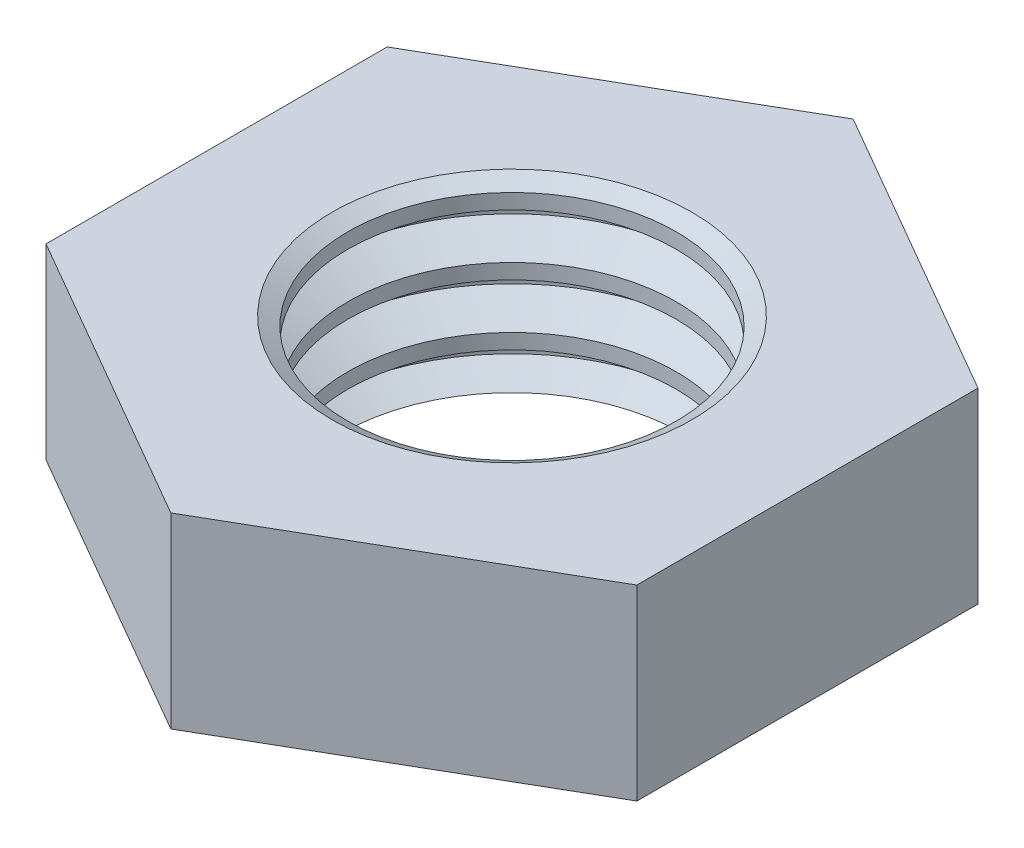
ISO-10303-21;
HEADER;
FILE_DESCRIPTION(('STEP AP214'),'2;1');
FILE_NAME('part.step','',(''),(''),'','','');
FILE_SCHEMA(('AUTOMOTIVE_DESIGN { 1 0 10303 214 1 1 1 1 }'));
ENDSEC;
DATA;
#1=APPLICATION_CONTEXT('core data for automotive mechanical design processes');
#2=APPLICATION_PROTOCOL_DEFINITION('international standard','automotive_design',2000,#1);
#3=PRODUCT_CONTEXT('',#1,'mechanical');
#4=PRODUCT('Part','Part','',(#3));
#5=PRODUCT_RELATED_PRODUCT_CATEGORY('part','',(#4));
#6=PRODUCT_DEFINITION_FORMATION('','',#4);
#7=PRODUCT_DEFINITION_CONTEXT('part definition',#1,'design');
#8=PRODUCT_DEFINITION('design','',#6,#7);
#9=PRODUCT_DEFINITION_SHAPE('','',#8);
#10=(LENGTH_UNIT() NAMED_UNIT(*) SI_UNIT(.MILLI.,.METRE.));
#11=(NAMED_UNIT(*) PLANE_ANGLE_UNIT() SI_UNIT($,.RADIAN.));
#12=(NAMED_UNIT(*) SI_UNIT($,.STERADIAN.) SOLID_ANGLE_UNIT());
#13=UNCERTAINTY_MEASURE_WITH_UNIT(LENGTH_MEASURE(1.E-05),#10,'distance_accuracy_value','');
#14=(GEOMETRIC_REPRESENTATION_CONTEXT(3) GLOBAL_UNCERTAINTY_ASSIGNED_CONTEXT((#13)) GLOBAL_UNIT_ASSIGNED_CONTEXT((#10,
#11,#12)) REPRESENTATION_CONTEXT('',''));
#15=CARTESIAN_POINT('',(0.,0.,0.));
#16=DIRECTION('',(0.,0.,1.));
#17=DIRECTION('',(1.,0.,0.));
#18=AXIS2_PLACEMENT_3D('',#15,#16,#17);
#19=CARTESIAN_POINT('',(0.,6.34999997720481,0.));
#20=DIRECTION('',(0.,1.,0.));
#21=DIRECTION('',(0.,0.,1.));
#22=AXIS2_PLACEMENT_3D('',#19,#20,#21);
#23=CONICAL_SURFACE('',#22,6.35000001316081,1.04719755);
#24=CARTESIAN_POINT('',(0.,5.73942307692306,0.));
#25=DIRECTION('',(0.,1.,0.));
#26=DIRECTION('',(0.,0.,1.));
#27=AXIS2_PLACEMENT_3D('',#24,#25,#26);
#28=CIRCLE('',#27,5.29244974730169);
#29=CARTESIAN_POINT('',(0.,5.73942307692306,5.29244974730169));
#30=VERTEX_POINT('',#29);
#31=EDGE_CURVE('E167',#30,#30,#28,.F.);
#32=ORIENTED_EDGE('',*,*,#31,.T.);
#33=EDGE_LOOP('',(#32));
#34=FACE_BOUND('',#33,.T.);
#35=CARTESIAN_POINT('',(0.,6.0325,0.));
#36=DIRECTION('',(0.,1.,0.));
#37=DIRECTION('',(0.,0.,1.));
#38=AXIS2_PLACEMENT_3D('',#35,#36,#37);
#39=CIRCLE('',#38,5.8000739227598);
#40=CARTESIAN_POINT('',(0.,6.0325,5.8000739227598));
#41=VERTEX_POINT('',#40);
#42=EDGE_CURVE('E172',#41,#41,#39,.F.);
#43=ORIENTED_EDGE('',*,*,#42,.F.);
#44=EDGE_LOOP('',(#43));
#45=FACE_BOUND('',#44,.T.);
#46=ADVANCED_FACE('F34',(#34,#45),#23,.F.);
#47=CARTESIAN_POINT('',(0.,11.1125,-10.9985226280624));
#48=DIRECTION('',(0.5,0.,0.866025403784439));
#49=DIRECTION('',(0.866025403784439,0.,-0.5));
#50=AXIS2_PLACEMENT_3D('',#47,#48,#49);
#51=PLANE('',#50);
#52=DIRECTION('',(-0.866025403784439,0.,0.5));
#53=VECTOR('',#52,1.);
#54=CARTESIAN_POINT('',(0.,6.0325,-10.9985226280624));
#55=LINE('',#54,#53);
#56=CARTESIAN_POINT('',(0.,6.0325,-10.9985226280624));
#57=VERTEX_POINT('',#56);
#58=CARTESIAN_POINT('',(-9.525,6.0325,-5.49926131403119));
#59=VERTEX_POINT('',#58);
#60=EDGE_CURVE('E226',#57,#59,#55,.T.);
#61=ORIENTED_EDGE('',*,*,#60,.F.);
#62=DIRECTION('',(0.,1.,0.));
#63=VECTOR('',#62,1.);
#64=CARTESIAN_POINT('',(0.,11.1125,-10.9985226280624));
#65=LINE('',#64,#63);
#66=CARTESIAN_POINT('',(0.,0.,-10.9985226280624));
#67=VERTEX_POINT('',#66);
#68=EDGE_CURVE('E102',#57,#67,#65,.F.);
#69=ORIENTED_EDGE('',*,*,#68,.T.);
#70=DIRECTION('',(-0.866025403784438,0.,0.500000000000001));
#71=VECTOR('',#70,1.);
#72=CARTESIAN_POINT('',(0.,0.,-10.9985226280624));
#73=LINE('',#72,#71);
#74=CARTESIAN_POINT('',(-9.525,0.,-5.4992613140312));
#75=VERTEX_POINT('',#74);
#76=EDGE_CURVE('E95',#67,#75,#73,.T.);
#77=ORIENTED_EDGE('',*,*,#76,.T.);
#78=DIRECTION('',(0.,1.,0.));
#79=VECTOR('',#78,1.);
#80=CARTESIAN_POINT('',(-9.525,11.1125,-5.49926131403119));
#81=LINE('',#80,#79);
#82=EDGE_CURVE('E77',#75,#59,#81,.T.);
#83=ORIENTED_EDGE('',*,*,#82,.T.);
#84=EDGE_LOOP('',(#61,#69,#77,#83));
#85=FACE_BOUND('',#84,.T.);
#86=ADVANCED_FACE('F100',(#85),#51,.F.);
#87=CARTESIAN_POINT('',(-9.525,11.1125,-5.49926131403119));
#88=DIRECTION('',(1.,0.,0.));
#89=DIRECTION('',(0.,0.,-1.));
#90=AXIS2_PLACEMENT_3D('',#87,#88,#89);
#91=PLANE('',#90);
#92=DIRECTION('',(0.,0.,1.));
#93=VECTOR('',#92,1.);
#94=CARTESIAN_POINT('',(-9.525,6.0325,-5.49926131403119));
#95=LINE('',#94,#93);
#96=CARTESIAN_POINT('',(-9.525,6.0325,5.49926131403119));
#97=VERTEX_POINT('',#96);
#98=EDGE_CURVE('E83',#59,#97,#95,.T.);
#99=ORIENTED_EDGE('',*,*,#98,.F.);
#100=ORIENTED_EDGE('',*,*,#82,.F.);
#101=DIRECTION('',(0.,0.,1.));
#102=VECTOR('',#101,1.);
#103=CARTESIAN_POINT('',(-9.525,0.,-16.4977839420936));
#104=LINE('',#103,#102);
#105=CARTESIAN_POINT('',(-9.525,0.,5.49926131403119));
#106=VERTEX_POINT('',#105);
#107=EDGE_CURVE('E81',#75,#106,#104,.T.);
#108=ORIENTED_EDGE('',*,*,#107,.T.);
#109=DIRECTION('',(0.,1.,0.));
#110=VECTOR('',#109,1.);
#111=CARTESIAN_POINT('',(-9.525,11.1125,5.49926131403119));
#112=LINE('',#111,#110);
#113=EDGE_CURVE('E87',#106,#97,#112,.T.);
#114=ORIENTED_EDGE('',*,*,#113,.T.);
#115=EDGE_LOOP('',(#99,#100,#108,#114));
#116=FACE_BOUND('',#115,.T.);
#117=ADVANCED_FACE('F79',(#116),#91,.F.);
#118=CARTESIAN_POINT('',(-9.525,11.1125,5.49926131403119));
#119=DIRECTION('',(0.5,0.,-0.866025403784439));
#120=DIRECTION('',(-0.866025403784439,0.,-0.5));
#121=AXIS2_PLACEMENT_3D('',#118,#119,#120);
#122=PLANE('',#121);
#123=DIRECTION('',(0.866025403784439,0.,0.5));
#124=VECTOR('',#123,1.);
#125=CARTESIAN_POINT('',(-9.525,6.0325,5.49926131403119));
#126=LINE('',#125,#124);
#127=CARTESIAN_POINT('',(0.,6.0325,10.9985226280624));
#128=VERTEX_POINT('',#127);
#129=EDGE_CURVE('E218',#97,#128,#126,.T.);
#130=ORIENTED_EDGE('',*,*,#129,.F.);
#131=ORIENTED_EDGE('',*,*,#113,.F.);
#132=DIRECTION('',(0.866025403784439,0.,0.499999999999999));
#133=VECTOR('',#132,1.);
#134=CARTESIAN_POINT('',(-9.525,0.,5.4992613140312));
#135=LINE('',#134,#133);
#136=CARTESIAN_POINT('',(0.,0.,10.9985226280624));
#137=VERTEX_POINT('',#136);
#138=EDGE_CURVE('E98',#106,#137,#135,.T.);
#139=ORIENTED_EDGE('',*,*,#138,.T.);
#140=DIRECTION('',(0.,1.,0.));
#141=VECTOR('',#140,1.);
#142=CARTESIAN_POINT('',(0.,11.1125,10.9985226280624));
#143=LINE('',#142,#141);
#144=EDGE_CURVE('E186',#137,#128,#143,.T.);
#145=ORIENTED_EDGE('',*,*,#144,.T.);
#146=EDGE_LOOP('',(#130,#131,#139,#145));
#147=FACE_BOUND('',#146,.T.);
#148=ADVANCED_FACE('F215',(#147),#122,.F.);
#149=CARTESIAN_POINT('',(0.,11.1125,10.9985226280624));
#150=DIRECTION('',(-0.5,0.,-0.866025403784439));
#151=DIRECTION('',(-0.866025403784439,0.,0.5));
#152=AXIS2_PLACEMENT_3D('',#149,#150,#151);
#153=PLANE('',#152);
#154=DIRECTION('',(0.866025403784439,0.,-0.5));
#155=VECTOR('',#154,1.);
#156=CARTESIAN_POINT('',(0.,6.0325,10.9985226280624));
#157=LINE('',#156,#155);
#158=CARTESIAN_POINT('',(9.525,6.0325,5.49926131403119));
#159=VERTEX_POINT('',#158);
#160=EDGE_CURVE('E212',#128,#159,#157,.T.);
#161=ORIENTED_EDGE('',*,*,#160,.F.);
#162=ORIENTED_EDGE('',*,*,#144,.F.);
#163=DIRECTION('',(0.866025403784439,0.,-0.499999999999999));
#164=VECTOR('',#163,1.);
#165=CARTESIAN_POINT('',(0.,0.,10.9985226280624));
#166=LINE('',#165,#164);
#167=CARTESIAN_POINT('',(9.525,0.,5.49926131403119));
#168=VERTEX_POINT('',#167);
#169=EDGE_CURVE('E113',#137,#168,#166,.T.);
#170=ORIENTED_EDGE('',*,*,#169,.T.);
#171=DIRECTION('',(0.,1.,0.));
#172=VECTOR('',#171,1.);
#173=CARTESIAN_POINT('',(9.525,11.1125,5.49926131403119));
#174=LINE('',#173,#172);
#175=EDGE_CURVE('E178',#168,#159,#174,.T.);
#176=ORIENTED_EDGE('',*,*,#175,.T.);
#177=EDGE_LOOP('',(#161,#162,#170,#176));
#178=FACE_BOUND('',#177,.T.);
#179=ADVANCED_FACE('F209',(#178),#153,.F.);
#180=CARTESIAN_POINT('',(9.525,11.1125,5.49926131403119));
#181=DIRECTION('',(-1.,0.,0.));
#182=DIRECTION('',(0.,0.,1.));
#183=AXIS2_PLACEMENT_3D('',#180,#181,#182);
#184=PLANE('',#183);
#185=DIRECTION('',(0.,0.,-1.));
#186=VECTOR('',#185,1.);
#187=CARTESIAN_POINT('',(9.525,6.0325,5.49926131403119));
#188=LINE('',#187,#186);
#189=CARTESIAN_POINT('',(9.525,6.0325,-5.49926131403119));
#190=VERTEX_POINT('',#189);
#191=EDGE_CURVE('E47',#159,#190,#188,.T.);
#192=ORIENTED_EDGE('',*,*,#191,.F.);
#193=ORIENTED_EDGE('',*,*,#175,.F.);
#194=DIRECTION('',(0.,0.,1.));
#195=VECTOR('',#194,1.);
#196=CARTESIAN_POINT('',(9.525,0.,-16.4977839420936));
#197=LINE('',#196,#195);
#198=CARTESIAN_POINT('',(9.525,0.,-5.49926131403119));
#199=VERTEX_POINT('',#198);
#200=EDGE_CURVE('E116',#168,#199,#197,.F.);
#201=ORIENTED_EDGE('',*,*,#200,.T.);
#202=DIRECTION('',(0.,1.,0.));
#203=VECTOR('',#202,1.);
#204=CARTESIAN_POINT('',(9.525,11.1125,-5.49926131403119));
#205=LINE('',#204,#203);
#206=EDGE_CURVE('E55',#199,#190,#205,.T.);
#207=ORIENTED_EDGE('',*,*,#206,.T.);
#208=EDGE_LOOP('',(#192,#193,#201,#207));
#209=FACE_BOUND('',#208,.T.);
#210=ADVANCED_FACE('F206',(#209),#184,.F.);
#211=CARTESIAN_POINT('',(9.525,11.1125,-5.49926131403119));
#212=DIRECTION('',(-0.5,0.,0.866025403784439));
#213=DIRECTION('',(0.866025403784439,0.,0.5));
#214=AXIS2_PLACEMENT_3D('',#211,#212,#213);
#215=PLANE('',#214);
#216=DIRECTION('',(-0.866025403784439,0.,-0.5));
#217=VECTOR('',#216,1.);
#218=CARTESIAN_POINT('',(9.525,6.0325,-5.49926131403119));
#219=LINE('',#218,#217);
#220=EDGE_CURVE('E11',#190,#57,#219,.T.);
#221=ORIENTED_EDGE('',*,*,#220,.F.);
#222=ORIENTED_EDGE('',*,*,#206,.F.);
#223=DIRECTION('',(-0.866025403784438,0.,-0.500000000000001));
#224=VECTOR('',#223,1.);
#225=CARTESIAN_POINT('',(9.525,0.,-5.4992613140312));
#226=LINE('',#225,#224);
#227=EDGE_CURVE('E176',#199,#67,#226,.T.);
#228=ORIENTED_EDGE('',*,*,#227,.T.);
#229=ORIENTED_EDGE('',*,*,#68,.F.);
#230=EDGE_LOOP('',(#221,#222,#228,#229));
#231=FACE_BOUND('',#230,.T.);
#232=ADVANCED_FACE('F228',(#231),#215,.F.);
#233=CARTESIAN_POINT('',(0.,-2.24411376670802,0.));
#234=DIRECTION('',(0.,1.,0.));
#235=DIRECTION('',(0.,0.,1.));
#236=AXIS2_PLACEMENT_3D('',#233,#234,#235);
#237=CYLINDRICAL_SURFACE('',#236,5.29244974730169);
#238=CARTESIAN_POINT('',(0.,5.25096156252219,0.));
#239=DIRECTION('',(0.,-1.,0.));
#240=DIRECTION('',(0.,0.,-1.));
#241=AXIS2_PLACEMENT_3D('',#238,#239,#240);
#242=CIRCLE('',#241,5.29244976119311);
#243=CARTESIAN_POINT('',(0.,5.25096156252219,-5.29244976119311));
#244=VERTEX_POINT('',#243);
#245=EDGE_CURVE('E162',#244,#244,#242,.T.);
#246=ORIENTED_EDGE('',*,*,#245,.T.);
#247=EDGE_LOOP('',(#246));
#248=FACE_BOUND('',#247,.T.);
#249=ORIENTED_EDGE('',*,*,#31,.F.);
#250=EDGE_LOOP('',(#249));
#251=FACE_BOUND('',#250,.T.);
#252=ADVANCED_FACE('F230',(#248,#251),#237,.F.);
#253=CARTESIAN_POINT('',(0.,4.6403846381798,0.));
#254=DIRECTION('',(0.,-1.,0.));
#255=DIRECTION('',(0.,0.,-1.));
#256=AXIS2_PLACEMENT_3D('',#253,#254,#255);
#257=CONICAL_SURFACE('',#256,6.3500000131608,1.04719755);
#258=ORIENTED_EDGE('',*,*,#245,.F.);
#259=EDGE_LOOP('',(#258));
#260=FACE_BOUND('',#259,.T.);
#261=CARTESIAN_POINT('',(0.,4.64038461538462,0.));
#262=DIRECTION('',(0.,1.,0.));
#263=DIRECTION('',(0.,0.,1.));
#264=AXIS2_PLACEMENT_3D('',#261,#262,#263);
#265=CIRCLE('',#264,6.35);
#266=CARTESIAN_POINT('',(0.,4.64038461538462,6.35));
#267=VERTEX_POINT('',#266);
#268=EDGE_CURVE('E157',#267,#267,#265,.F.);
#269=ORIENTED_EDGE('',*,*,#268,.T.);
#270=EDGE_LOOP('',(#269));
#271=FACE_BOUND('',#270,.T.);
#272=ADVANCED_FACE('F236',(#260,#271),#257,.F.);
#273=CARTESIAN_POINT('',(0.,-4.19795992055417,0.));
#274=DIRECTION('',(0.,1.,0.));
#275=DIRECTION('',(0.,0.,1.));
#276=AXIS2_PLACEMENT_3D('',#273,#274,#275);
#277=CYLINDRICAL_SURFACE('',#276,6.35);
#278=CARTESIAN_POINT('',(0.,4.39615382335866,0.));
#279=DIRECTION('',(0.,1.,0.));
#280=DIRECTION('',(0.,0.,1.));
#281=AXIS2_PLACEMENT_3D('',#278,#279,#280);
#282=CIRCLE('',#281,6.35000001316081);
#283=CARTESIAN_POINT('',(0.,4.39615382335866,6.35000001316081));
#284=VERTEX_POINT('',#283);
#285=EDGE_CURVE('E152',#284,#284,#282,.F.);
#286=ORIENTED_EDGE('',*,*,#285,.T.);
#287=EDGE_LOOP('',(#286));
#288=FACE_BOUND('',#287,.T.);
#289=ORIENTED_EDGE('',*,*,#268,.F.);
#290=EDGE_LOOP('',(#289));
#291=FACE_BOUND('',#290,.T.);
#292=ADVANCED_FACE('F310',(#288,#291),#277,.F.);
#293=CARTESIAN_POINT('',(0.,4.39615382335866,0.));
#294=DIRECTION('',(0.,1.,0.));
#295=DIRECTION('',(0.,0.,1.));
#296=AXIS2_PLACEMENT_3D('',#293,#294,#295);
#297=CONICAL_SURFACE('',#296,6.35000001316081,1.04719755);
#298=CARTESIAN_POINT('',(0.,3.78557692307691,0.));
#299=DIRECTION('',(0.,1.,0.));
#300=DIRECTION('',(0.,0.,1.));
#301=AXIS2_PLACEMENT_3D('',#298,#299,#300);
#302=CIRCLE('',#301,5.29244974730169);
#303=CARTESIAN_POINT('',(0.,3.78557692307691,5.29244974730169));
#304=VERTEX_POINT('',#303);
#305=EDGE_CURVE('E147',#304,#304,#302,.F.);
#306=ORIENTED_EDGE('',*,*,#305,.T.);
#307=EDGE_LOOP('',(#306));
#308=FACE_BOUND('',#307,.T.);
#309=ORIENTED_EDGE('',*,*,#285,.F.);
#310=EDGE_LOOP('',(#309));
#311=FACE_BOUND('',#310,.T.);
#312=ADVANCED_FACE('F306',(#308,#311),#297,.F.);
#313=CARTESIAN_POINT('',(0.,-4.19795992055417,0.));
#314=DIRECTION('',(0.,1.,0.));
#315=DIRECTION('',(0.,0.,1.));
#316=AXIS2_PLACEMENT_3D('',#313,#314,#315);
#317=CYLINDRICAL_SURFACE('',#316,5.29244974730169);
#318=CARTESIAN_POINT('',(0.,3.29711540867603,0.));
#319=DIRECTION('',(0.,-1.,0.));
#320=DIRECTION('',(0.,0.,-1.));
#321=AXIS2_PLACEMENT_3D('',#318,#319,#320);
#322=CIRCLE('',#321,5.29244976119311);
#323=CARTESIAN_POINT('',(0.,3.29711540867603,-5.29244976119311));
#324=VERTEX_POINT('',#323);
#325=EDGE_CURVE('E142',#324,#324,#322,.T.);
#326=ORIENTED_EDGE('',*,*,#325,.T.);
#327=EDGE_LOOP('',(#326));
#328=FACE_BOUND('',#327,.T.);
#329=ORIENTED_EDGE('',*,*,#305,.F.);
#330=EDGE_LOOP('',(#329));
#331=FACE_BOUND('',#330,.T.);
#332=ADVANCED_FACE('F302',(#328,#331),#317,.F.);
#333=CARTESIAN_POINT('',(0.,2.68653848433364,0.));
#334=DIRECTION('',(0.,-1.,0.));
#335=DIRECTION('',(0.,0.,-1.));
#336=AXIS2_PLACEMENT_3D('',#333,#334,#335);
#337=CONICAL_SURFACE('',#336,6.3500000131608,1.04719755);
#338=ORIENTED_EDGE('',*,*,#325,.F.);
#339=EDGE_LOOP('',(#338));
#340=FACE_BOUND('',#339,.T.);
#341=CARTESIAN_POINT('',(0.,2.68653846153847,0.));
#342=DIRECTION('',(0.,1.,0.));
#343=DIRECTION('',(0.,0.,1.));
#344=AXIS2_PLACEMENT_3D('',#341,#342,#343);
#345=CIRCLE('',#344,6.35);
#346=CARTESIAN_POINT('',(0.,2.68653846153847,6.35));
#347=VERTEX_POINT('',#346);
#348=EDGE_CURVE('E137',#347,#347,#345,.F.);
#349=ORIENTED_EDGE('',*,*,#348,.T.);
#350=EDGE_LOOP('',(#349));
#351=FACE_BOUND('',#350,.T.);
#352=ADVANCED_FACE('F298',(#340,#351),#337,.F.);
#353=CARTESIAN_POINT('',(0.,-6.15180607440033,0.));
#354=DIRECTION('',(0.,1.,0.));
#355=DIRECTION('',(0.,0.,1.));
#356=AXIS2_PLACEMENT_3D('',#353,#354,#355);
#357=CYLINDRICAL_SURFACE('',#356,6.35);
#358=CARTESIAN_POINT('',(0.,2.4423076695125,0.));
#359=DIRECTION('',(0.,1.,0.));
#360=DIRECTION('',(0.,0.,1.));
#361=AXIS2_PLACEMENT_3D('',#358,#359,#360);
#362=CIRCLE('',#361,6.35000001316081);
#363=CARTESIAN_POINT('',(0.,2.4423076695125,6.35000001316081));
#364=VERTEX_POINT('',#363);
#365=EDGE_CURVE('E132',#364,#364,#362,.F.);
#366=ORIENTED_EDGE('',*,*,#365,.T.);
#367=EDGE_LOOP('',(#366));
#368=FACE_BOUND('',#367,.T.);
#369=ORIENTED_EDGE('',*,*,#348,.F.);
#370=EDGE_LOOP('',(#369));
#371=FACE_BOUND('',#370,.T.);
#372=ADVANCED_FACE('F294',(#368,#371),#357,.F.);
#373=CARTESIAN_POINT('',(0.,2.4423076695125,0.));
#374=DIRECTION('',(0.,1.,0.));
#375=DIRECTION('',(0.,0.,1.));
#376=AXIS2_PLACEMENT_3D('',#373,#374,#375);
#377=CONICAL_SURFACE('',#376,6.35000001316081,1.04719755);
#378=CARTESIAN_POINT('',(0.,1.83173076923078,0.));
#379=DIRECTION('',(0.,1.,0.));
#380=DIRECTION('',(0.,0.,1.));
#381=AXIS2_PLACEMENT_3D('',#378,#379,#380);
#382=CIRCLE('',#381,5.29244974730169);
#383=CARTESIAN_POINT('',(0.,1.83173076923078,5.29244974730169));
#384=VERTEX_POINT('',#383);
#385=EDGE_CURVE('E127',#384,#384,#382,.F.);
#386=ORIENTED_EDGE('',*,*,#385,.T.);
#387=EDGE_LOOP('',(#386));
#388=FACE_BOUND('',#387,.T.);
#389=ORIENTED_EDGE('',*,*,#365,.F.);
#390=EDGE_LOOP('',(#389));
#391=FACE_BOUND('',#390,.T.);
#392=ADVANCED_FACE('F287',(#388,#391),#377,.F.);
#393=CARTESIAN_POINT('',(0.,-6.15180607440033,0.));
#394=DIRECTION('',(0.,1.,0.));
#395=DIRECTION('',(0.,0.,1.));
#396=AXIS2_PLACEMENT_3D('',#393,#394,#395);
#397=CYLINDRICAL_SURFACE('',#396,5.29244974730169);
#398=CARTESIAN_POINT('',(0.,1.34326925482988,0.));
#399=DIRECTION('',(0.,-1.,0.));
#400=DIRECTION('',(0.,0.,-1.));
#401=AXIS2_PLACEMENT_3D('',#398,#399,#400);
#402=CIRCLE('',#401,5.29244976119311);
#403=CARTESIAN_POINT('',(0.,1.34326925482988,-5.29244976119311));
#404=VERTEX_POINT('',#403);
#405=EDGE_CURVE('E124',#404,#404,#402,.T.);
#406=ORIENTED_EDGE('',*,*,#405,.T.);
#407=EDGE_LOOP('',(#406));
#408=FACE_BOUND('',#407,.T.);
#409=ORIENTED_EDGE('',*,*,#385,.F.);
#410=EDGE_LOOP('',(#409));
#411=FACE_BOUND('',#410,.T.);
#412=ADVANCED_FACE('F281',(#408,#411),#397,.F.);
#413=CARTESIAN_POINT('',(0.,0.73269233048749,0.));
#414=DIRECTION('',(0.,-1.,0.));
#415=DIRECTION('',(0.,0.,-1.));
#416=AXIS2_PLACEMENT_3D('',#413,#414,#415);
#417=CONICAL_SURFACE('',#416,6.3500000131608,1.04719755);
#418=ORIENTED_EDGE('',*,*,#405,.F.);
#419=EDGE_LOOP('',(#418));
#420=FACE_BOUND('',#419,.T.);
#421=CARTESIAN_POINT('',(0.,0.732692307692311,0.));
#422=DIRECTION('',(0.,1.,0.));
#423=DIRECTION('',(0.,0.,1.));
#424=AXIS2_PLACEMENT_3D('',#421,#422,#423);
#425=CIRCLE('',#424,6.35);
#426=CARTESIAN_POINT('',(0.,0.732692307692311,6.35));
#427=VERTEX_POINT('',#426);
#428=EDGE_CURVE('E88',#427,#427,#425,.F.);
#429=ORIENTED_EDGE('',*,*,#428,.T.);
#430=EDGE_LOOP('',(#429));
#431=FACE_BOUND('',#430,.T.);
#432=ADVANCED_FACE('F271',(#420,#431),#417,.F.);
#433=CARTESIAN_POINT('',(0.,-8.10565222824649,0.));
#434=DIRECTION('',(0.,1.,0.));
#435=DIRECTION('',(0.,0.,1.));
#436=AXIS2_PLACEMENT_3D('',#433,#434,#435);
#437=CYLINDRICAL_SURFACE('',#436,6.35);
#438=CARTESIAN_POINT('',(0.,0.488461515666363,0.));
#439=DIRECTION('',(0.,1.,0.));
#440=DIRECTION('',(0.,0.,1.));
#441=AXIS2_PLACEMENT_3D('',#438,#439,#440);
#442=CIRCLE('',#441,6.3500000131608);
#443=CARTESIAN_POINT('',(0.,0.488461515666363,6.3500000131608));
#444=VERTEX_POINT('',#443);
#445=EDGE_CURVE('E103',#444,#444,#442,.F.);
#446=ORIENTED_EDGE('',*,*,#445,.T.);
#447=EDGE_LOOP('',(#446));
#448=FACE_BOUND('',#447,.T.);
#449=ORIENTED_EDGE('',*,*,#428,.F.);
#450=EDGE_LOOP('',(#449));
#451=FACE_BOUND('',#450,.T.);
#452=ADVANCED_FACE('F266',(#448,#451),#437,.F.);
#453=CARTESIAN_POINT('',(0.,0.488461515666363,0.));
#454=DIRECTION('',(0.,1.,0.));
#455=DIRECTION('',(0.,0.,1.));
#456=AXIS2_PLACEMENT_3D('',#453,#454,#455);
#457=CONICAL_SURFACE('',#456,6.3500000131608,1.04719755);
#458=CARTESIAN_POINT('',(0.,-2.3807547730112E-08,0.));
#459=DIRECTION('',(0.,1.,0.));
#460=DIRECTION('',(0.,0.,1.));
#461=AXIS2_PLACEMENT_3D('',#458,#459,#460);
#462=CIRCLE('',#461,5.50395981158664);
#463=CARTESIAN_POINT('',(0.,-2.3807547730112E-08,5.50395981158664));
#464=VERTEX_POINT('',#463);
#465=EDGE_CURVE('E41',#464,#464,#462,.F.);
#466=ORIENTED_EDGE('',*,*,#465,.T.);
#467=EDGE_LOOP('',(#466));
#468=FACE_BOUND('',#467,.T.);
#469=ORIENTED_EDGE('',*,*,#445,.F.);
#470=EDGE_LOOP('',(#469));
#471=FACE_BOUND('',#470,.T.);
#472=ADVANCED_FACE('F241',(#468,#471),#457,.F.);
#473=CARTESIAN_POINT('',(-9.525,0.,-16.4977839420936));
#474=DIRECTION('',(0.,1.,0.));
#475=DIRECTION('',(0.,0.,1.));
#476=AXIS2_PLACEMENT_3D('',#473,#474,#475);
#477=PLANE('',#476);
#478=ORIENTED_EDGE('',*,*,#465,.F.);
#479=EDGE_LOOP('',(#478));
#480=FACE_BOUND('',#479,.T.);
#481=ORIENTED_EDGE('',*,*,#200,.F.);
#482=ORIENTED_EDGE('',*,*,#169,.F.);
#483=ORIENTED_EDGE('',*,*,#138,.F.);
#484=ORIENTED_EDGE('',*,*,#107,.F.);
#485=ORIENTED_EDGE('',*,*,#76,.F.);
#486=ORIENTED_EDGE('',*,*,#227,.F.);
#487=EDGE_LOOP('',(#481,#482,#483,#484,#485,#486));
#488=FACE_BOUND('',#487,.T.);
#489=ADVANCED_FACE('F94',(#480,#488),#477,.F.);
#490=CARTESIAN_POINT('',(0.,6.0325,0.));
#491=DIRECTION('',(0.,1.,0.));
#492=DIRECTION('',(0.,0.,1.));
#493=AXIS2_PLACEMENT_3D('',#490,#491,#492);
#494=PLANE('',#493);
#495=ORIENTED_EDGE('',*,*,#60,.T.);
#496=ORIENTED_EDGE('',*,*,#98,.T.);
#497=ORIENTED_EDGE('',*,*,#129,.T.);
#498=ORIENTED_EDGE('',*,*,#160,.T.);
#499=ORIENTED_EDGE('',*,*,#191,.T.);
#500=ORIENTED_EDGE('',*,*,#220,.T.);
#501=EDGE_LOOP('',(#495,#496,#497,#498,#499,#500));
#502=FACE_BOUND('',#501,.T.);
#503=ORIENTED_EDGE('',*,*,#42,.T.);
#504=EDGE_LOOP('',(#503));
#505=FACE_BOUND('',#504,.T.);
#506=ADVANCED_FACE('F224',(#502,#505),#494,.T.);
#507=CLOSED_SHELL('',(#46,#86,#117,#148,#179,#210,#232,#252,#272,#292,#312,#332,#352,#372,#392,
#412,#432,#452,#472,#489,#506));
#508=MANIFOLD_SOLID_BREP('B2',#507);
#509=ADVANCED_BREP_SHAPE_REPRESENTATION('',(#18,#508),#14);
#510=SHAPE_DEFINITION_REPRESENTATION(#9,#509);
ENDSEC;
END-ISO-10303-21;
